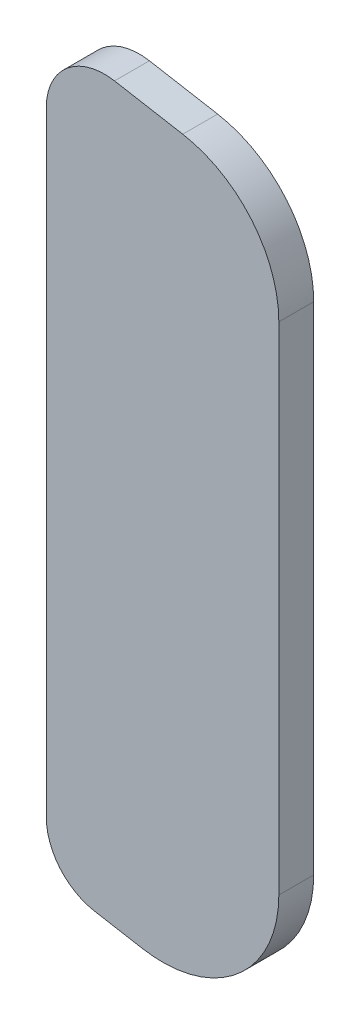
from build123d import *

# Parameters (mm, degrees)
EXTRUSION1_DEPTH = 3


with BuildPart() as part:
    # Esquisse1 → Extrusion1 (new body)
    with BuildSketch(Plane.XY):
        with BuildLine():
            Line((-10.781678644, 17.270229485), (-4.913437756, 16.235500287))
            ThreePointArc((-4.913437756, 16.235500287), (1.010524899, 12.815298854), (3.350080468, 6.387422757))
            Line((3.350080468, 6.387422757), (3.350080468, -36.304045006))
            ThreePointArc((3.350080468, -36.304045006), (-0.222043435, -43.964489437), (-8.386401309, -46.152122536))
            Line((-8.386401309, -46.152122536), (-12.518160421, -45.423581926))
            ThreePointArc((-12.518160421, -45.423581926), (-15.480141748, -43.71348121), (-16.649919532, -40.499543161))
            Line((-16.649919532, -40.499543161), (-16.649919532, 12.34619072))
            ThreePointArc((-16.649919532, 12.34619072), (-14.863857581, 16.176412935), (-10.781678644, 17.270229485))
        make_face()
    extrude(amount=EXTRUSION1_DEPTH)


solid = part.part
